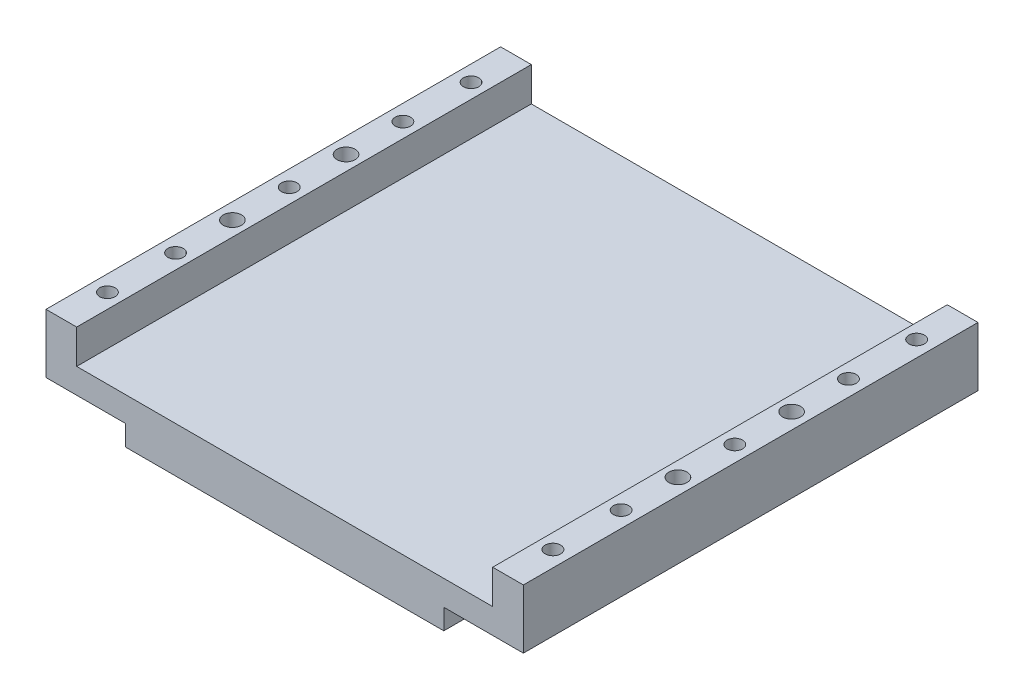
ISO-10303-21;
HEADER;
FILE_DESCRIPTION(('STEP AP214'),'2;1');
FILE_NAME('part.step','',(''),(''),'','','');
FILE_SCHEMA(('AUTOMOTIVE_DESIGN { 1 0 10303 214 1 1 1 1 }'));
ENDSEC;
DATA;
#1=APPLICATION_CONTEXT('core data for automotive mechanical design processes');
#2=APPLICATION_PROTOCOL_DEFINITION('international standard','automotive_design',2000,#1);
#3=PRODUCT_CONTEXT('',#1,'mechanical');
#4=PRODUCT('Part','Part','',(#3));
#5=PRODUCT_RELATED_PRODUCT_CATEGORY('part','',(#4));
#6=PRODUCT_DEFINITION_FORMATION('','',#4);
#7=PRODUCT_DEFINITION_CONTEXT('part definition',#1,'design');
#8=PRODUCT_DEFINITION('design','',#6,#7);
#9=PRODUCT_DEFINITION_SHAPE('','',#8);
#10=(LENGTH_UNIT() NAMED_UNIT(*) SI_UNIT(.MILLI.,.METRE.));
#11=(NAMED_UNIT(*) PLANE_ANGLE_UNIT() SI_UNIT($,.RADIAN.));
#12=(NAMED_UNIT(*) SI_UNIT($,.STERADIAN.) SOLID_ANGLE_UNIT());
#13=UNCERTAINTY_MEASURE_WITH_UNIT(LENGTH_MEASURE(1.E-05),#10,'distance_accuracy_value','');
#14=(GEOMETRIC_REPRESENTATION_CONTEXT(3) GLOBAL_UNCERTAINTY_ASSIGNED_CONTEXT((#13)) GLOBAL_UNIT_ASSIGNED_CONTEXT((#10,
#11,#12)) REPRESENTATION_CONTEXT('',''));
#15=CARTESIAN_POINT('',(0.,0.,0.));
#16=DIRECTION('',(0.,0.,1.));
#17=DIRECTION('',(1.,0.,0.));
#18=AXIS2_PLACEMENT_3D('',#15,#16,#17);
#19=CARTESIAN_POINT('',(-98.,23.,50.));
#20=DIRECTION('',(0.,1.,0.));
#21=DIRECTION('',(0.,0.,1.));
#22=AXIS2_PLACEMENT_3D('',#19,#20,#21);
#23=PLANE('',#22);
#24=CARTESIAN_POINT('',(-98.,23.,50.));
#25=DIRECTION('',(0.,1.,0.));
#26=DIRECTION('',(0.,0.,1.));
#27=AXIS2_PLACEMENT_3D('',#24,#25,#26);
#28=CIRCLE('',#27,3.4);
#29=CARTESIAN_POINT('',(-98.,23.,53.4));
#30=VERTEX_POINT('',#29);
#31=EDGE_CURVE('E19',#30,#30,#28,.T.);
#32=ORIENTED_EDGE('',*,*,#31,.T.);
#33=EDGE_LOOP('',(#32));
#34=FACE_BOUND('',#33,.T.);
#35=ADVANCED_FACE('F16',(#34),#23,.T.);
#36=CARTESIAN_POINT('',(-98.,23.,-50.));
#37=DIRECTION('',(0.,1.,0.));
#38=DIRECTION('',(0.,0.,1.));
#39=AXIS2_PLACEMENT_3D('',#36,#37,#38);
#40=PLANE('',#39);
#41=CARTESIAN_POINT('',(-98.,23.,-50.));
#42=DIRECTION('',(0.,1.,0.));
#43=DIRECTION('',(0.,0.,1.));
#44=AXIS2_PLACEMENT_3D('',#41,#42,#43);
#45=CIRCLE('',#44,3.4);
#46=CARTESIAN_POINT('',(-98.,23.,-46.6));
#47=VERTEX_POINT('',#46);
#48=EDGE_CURVE('E224',#47,#47,#45,.T.);
#49=ORIENTED_EDGE('',*,*,#48,.T.);
#50=EDGE_LOOP('',(#49));
#51=FACE_BOUND('',#50,.T.);
#52=ADVANCED_FACE('F359',(#51),#40,.T.);
#53=CARTESIAN_POINT('',(-98.,23.,80.));
#54=DIRECTION('',(0.,1.,0.));
#55=DIRECTION('',(0.,0.,1.));
#56=AXIS2_PLACEMENT_3D('',#53,#54,#55);
#57=PLANE('',#56);
#58=CARTESIAN_POINT('',(-98.,23.,80.));
#59=DIRECTION('',(0.,1.,0.));
#60=DIRECTION('',(0.,0.,1.));
#61=AXIS2_PLACEMENT_3D('',#58,#59,#60);
#62=CIRCLE('',#61,3.4);
#63=CARTESIAN_POINT('',(-98.,23.,83.4));
#64=VERTEX_POINT('',#63);
#65=EDGE_CURVE('E222',#64,#64,#62,.T.);
#66=ORIENTED_EDGE('',*,*,#65,.T.);
#67=EDGE_LOOP('',(#66));
#68=FACE_BOUND('',#67,.T.);
#69=ADVANCED_FACE('F356',(#68),#57,.T.);
#70=CARTESIAN_POINT('',(-98.,23.,0.));
#71=DIRECTION('',(0.,1.,0.));
#72=DIRECTION('',(0.,0.,1.));
#73=AXIS2_PLACEMENT_3D('',#70,#71,#72);
#74=PLANE('',#73);
#75=CARTESIAN_POINT('',(-98.,23.,0.));
#76=DIRECTION('',(0.,1.,0.));
#77=DIRECTION('',(0.,0.,1.));
#78=AXIS2_PLACEMENT_3D('',#75,#76,#77);
#79=CIRCLE('',#78,3.4);
#80=CARTESIAN_POINT('',(-98.,23.,3.4));
#81=VERTEX_POINT('',#80);
#82=EDGE_CURVE('E219',#81,#81,#79,.T.);
#83=ORIENTED_EDGE('',*,*,#82,.T.);
#84=EDGE_LOOP('',(#83));
#85=FACE_BOUND('',#84,.T.);
#86=ADVANCED_FACE('F358',(#85),#74,.T.);
#87=CARTESIAN_POINT('',(-98.,23.,-80.));
#88=DIRECTION('',(0.,1.,0.));
#89=DIRECTION('',(0.,0.,1.));
#90=AXIS2_PLACEMENT_3D('',#87,#88,#89);
#91=PLANE('',#90);
#92=CARTESIAN_POINT('',(-98.,23.,-80.));
#93=DIRECTION('',(0.,1.,0.));
#94=DIRECTION('',(0.,0.,1.));
#95=AXIS2_PLACEMENT_3D('',#92,#93,#94);
#96=CIRCLE('',#95,3.4);
#97=CARTESIAN_POINT('',(-98.,23.,-76.6));
#98=VERTEX_POINT('',#97);
#99=EDGE_CURVE('E216',#98,#98,#96,.T.);
#100=ORIENTED_EDGE('',*,*,#99,.T.);
#101=EDGE_LOOP('',(#100));
#102=FACE_BOUND('',#101,.T.);
#103=ADVANCED_FACE('F365',(#102),#91,.T.);
#104=CARTESIAN_POINT('',(98.,23.,50.));
#105=DIRECTION('',(0.,1.,0.));
#106=DIRECTION('',(0.,0.,1.));
#107=AXIS2_PLACEMENT_3D('',#104,#105,#106);
#108=PLANE('',#107);
#109=CARTESIAN_POINT('',(98.,23.,50.));
#110=DIRECTION('',(0.,1.,0.));
#111=DIRECTION('',(0.,0.,1.));
#112=AXIS2_PLACEMENT_3D('',#109,#110,#111);
#113=CIRCLE('',#112,3.4);
#114=CARTESIAN_POINT('',(98.,23.,53.4));
#115=VERTEX_POINT('',#114);
#116=EDGE_CURVE('E213',#115,#115,#113,.T.);
#117=ORIENTED_EDGE('',*,*,#116,.T.);
#118=EDGE_LOOP('',(#117));
#119=FACE_BOUND('',#118,.T.);
#120=ADVANCED_FACE('F371',(#119),#108,.T.);
#121=CARTESIAN_POINT('',(98.,23.,-50.));
#122=DIRECTION('',(0.,1.,0.));
#123=DIRECTION('',(0.,0.,1.));
#124=AXIS2_PLACEMENT_3D('',#121,#122,#123);
#125=PLANE('',#124);
#126=CARTESIAN_POINT('',(98.,23.,-50.));
#127=DIRECTION('',(0.,1.,0.));
#128=DIRECTION('',(0.,0.,1.));
#129=AXIS2_PLACEMENT_3D('',#126,#127,#128);
#130=CIRCLE('',#129,3.4);
#131=CARTESIAN_POINT('',(98.,23.,-46.6));
#132=VERTEX_POINT('',#131);
#133=EDGE_CURVE('E210',#132,#132,#130,.T.);
#134=ORIENTED_EDGE('',*,*,#133,.T.);
#135=EDGE_LOOP('',(#134));
#136=FACE_BOUND('',#135,.T.);
#137=ADVANCED_FACE('F375',(#136),#125,.T.);
#138=CARTESIAN_POINT('',(98.,23.,-80.));
#139=DIRECTION('',(0.,1.,0.));
#140=DIRECTION('',(0.,0.,1.));
#141=AXIS2_PLACEMENT_3D('',#138,#139,#140);
#142=PLANE('',#141);
#143=CARTESIAN_POINT('',(98.,23.,-80.));
#144=DIRECTION('',(0.,1.,0.));
#145=DIRECTION('',(0.,0.,1.));
#146=AXIS2_PLACEMENT_3D('',#143,#144,#145);
#147=CIRCLE('',#146,3.4);
#148=CARTESIAN_POINT('',(98.,23.,-76.6));
#149=VERTEX_POINT('',#148);
#150=EDGE_CURVE('E207',#149,#149,#147,.T.);
#151=ORIENTED_EDGE('',*,*,#150,.T.);
#152=EDGE_LOOP('',(#151));
#153=FACE_BOUND('',#152,.T.);
#154=ADVANCED_FACE('F379',(#153),#142,.T.);
#155=CARTESIAN_POINT('',(98.,23.,0.));
#156=DIRECTION('',(0.,1.,0.));
#157=DIRECTION('',(0.,0.,1.));
#158=AXIS2_PLACEMENT_3D('',#155,#156,#157);
#159=PLANE('',#158);
#160=CARTESIAN_POINT('',(98.,23.,0.));
#161=DIRECTION('',(0.,1.,0.));
#162=DIRECTION('',(0.,0.,1.));
#163=AXIS2_PLACEMENT_3D('',#160,#161,#162);
#164=CIRCLE('',#163,3.4);
#165=CARTESIAN_POINT('',(98.,23.,3.4));
#166=VERTEX_POINT('',#165);
#167=EDGE_CURVE('E204',#166,#166,#164,.T.);
#168=ORIENTED_EDGE('',*,*,#167,.T.);
#169=EDGE_LOOP('',(#168));
#170=FACE_BOUND('',#169,.T.);
#171=ADVANCED_FACE('F246',(#170),#159,.T.);
#172=CARTESIAN_POINT('',(98.,23.,80.));
#173=DIRECTION('',(0.,1.,0.));
#174=DIRECTION('',(0.,0.,1.));
#175=AXIS2_PLACEMENT_3D('',#172,#173,#174);
#176=PLANE('',#175);
#177=CARTESIAN_POINT('',(98.,23.,80.));
#178=DIRECTION('',(0.,1.,0.));
#179=DIRECTION('',(0.,0.,1.));
#180=AXIS2_PLACEMENT_3D('',#177,#178,#179);
#181=CIRCLE('',#180,3.4);
#182=CARTESIAN_POINT('',(98.,23.,83.4));
#183=VERTEX_POINT('',#182);
#184=EDGE_CURVE('E124',#183,#183,#181,.T.);
#185=ORIENTED_EDGE('',*,*,#184,.T.);
#186=EDGE_LOOP('',(#185));
#187=FACE_BOUND('',#186,.T.);
#188=ADVANCED_FACE('F235',(#187),#176,.T.);
#189=CARTESIAN_POINT('',(-98.,23.,50.));
#190=DIRECTION('',(0.,1.,0.));
#191=DIRECTION('',(0.,0.,1.));
#192=AXIS2_PLACEMENT_3D('',#189,#190,#191);
#193=CYLINDRICAL_SURFACE('',#192,3.4);
#194=CARTESIAN_POINT('',(-98.,35.,50.));
#195=DIRECTION('',(0.,1.,0.));
#196=DIRECTION('',(0.,0.,1.));
#197=AXIS2_PLACEMENT_3D('',#194,#195,#196);
#198=CIRCLE('',#197,3.4);
#199=CARTESIAN_POINT('',(-98.,35.,53.4));
#200=VERTEX_POINT('',#199);
#201=EDGE_CURVE('E193',#200,#200,#198,.F.);
#202=ORIENTED_EDGE('',*,*,#201,.F.);
#203=EDGE_LOOP('',(#202));
#204=FACE_BOUND('',#203,.T.);
#205=ORIENTED_EDGE('',*,*,#31,.F.);
#206=EDGE_LOOP('',(#205));
#207=FACE_BOUND('',#206,.T.);
#208=ADVANCED_FACE('F232',(#204,#207),#193,.F.);
#209=CARTESIAN_POINT('',(-98.,23.,-50.));
#210=DIRECTION('',(0.,1.,0.));
#211=DIRECTION('',(0.,0.,1.));
#212=AXIS2_PLACEMENT_3D('',#209,#210,#211);
#213=CYLINDRICAL_SURFACE('',#212,3.4);
#214=CARTESIAN_POINT('',(-98.,35.,-50.));
#215=DIRECTION('',(0.,1.,0.));
#216=DIRECTION('',(0.,0.,1.));
#217=AXIS2_PLACEMENT_3D('',#214,#215,#216);
#218=CIRCLE('',#217,3.4);
#219=CARTESIAN_POINT('',(-98.,35.,-46.6));
#220=VERTEX_POINT('',#219);
#221=EDGE_CURVE('E190',#220,#220,#218,.F.);
#222=ORIENTED_EDGE('',*,*,#221,.F.);
#223=EDGE_LOOP('',(#222));
#224=FACE_BOUND('',#223,.T.);
#225=ORIENTED_EDGE('',*,*,#48,.F.);
#226=EDGE_LOOP('',(#225));
#227=FACE_BOUND('',#226,.T.);
#228=ADVANCED_FACE('F234',(#224,#227),#213,.F.);
#229=CARTESIAN_POINT('',(-98.,23.,80.));
#230=DIRECTION('',(0.,1.,0.));
#231=DIRECTION('',(0.,0.,1.));
#232=AXIS2_PLACEMENT_3D('',#229,#230,#231);
#233=CYLINDRICAL_SURFACE('',#232,3.4);
#234=CARTESIAN_POINT('',(-98.,35.,80.));
#235=DIRECTION('',(0.,1.,0.));
#236=DIRECTION('',(0.,0.,1.));
#237=AXIS2_PLACEMENT_3D('',#234,#235,#236);
#238=CIRCLE('',#237,3.4);
#239=CARTESIAN_POINT('',(-98.,35.,83.4));
#240=VERTEX_POINT('',#239);
#241=EDGE_CURVE('E187',#240,#240,#238,.F.);
#242=ORIENTED_EDGE('',*,*,#241,.F.);
#243=EDGE_LOOP('',(#242));
#244=FACE_BOUND('',#243,.T.);
#245=ORIENTED_EDGE('',*,*,#65,.F.);
#246=EDGE_LOOP('',(#245));
#247=FACE_BOUND('',#246,.T.);
#248=ADVANCED_FACE('F243',(#244,#247),#233,.F.);
#249=CARTESIAN_POINT('',(-98.,23.,0.));
#250=DIRECTION('',(0.,1.,0.));
#251=DIRECTION('',(0.,0.,1.));
#252=AXIS2_PLACEMENT_3D('',#249,#250,#251);
#253=CYLINDRICAL_SURFACE('',#252,3.4);
#254=CARTESIAN_POINT('',(-98.,35.,0.));
#255=DIRECTION('',(0.,1.,0.));
#256=DIRECTION('',(0.,0.,1.));
#257=AXIS2_PLACEMENT_3D('',#254,#255,#256);
#258=CIRCLE('',#257,3.4);
#259=CARTESIAN_POINT('',(-98.,35.,3.4));
#260=VERTEX_POINT('',#259);
#261=EDGE_CURVE('E184',#260,#260,#258,.F.);
#262=ORIENTED_EDGE('',*,*,#261,.F.);
#263=EDGE_LOOP('',(#262));
#264=FACE_BOUND('',#263,.T.);
#265=ORIENTED_EDGE('',*,*,#82,.F.);
#266=EDGE_LOOP('',(#265));
#267=FACE_BOUND('',#266,.T.);
#268=ADVANCED_FACE('F343',(#264,#267),#253,.F.);
#269=CARTESIAN_POINT('',(-98.,23.,-80.));
#270=DIRECTION('',(0.,1.,0.));
#271=DIRECTION('',(0.,0.,1.));
#272=AXIS2_PLACEMENT_3D('',#269,#270,#271);
#273=CYLINDRICAL_SURFACE('',#272,3.4);
#274=CARTESIAN_POINT('',(-98.,35.,-80.));
#275=DIRECTION('',(0.,1.,0.));
#276=DIRECTION('',(0.,0.,1.));
#277=AXIS2_PLACEMENT_3D('',#274,#275,#276);
#278=CIRCLE('',#277,3.4);
#279=CARTESIAN_POINT('',(-98.,35.,-76.6));
#280=VERTEX_POINT('',#279);
#281=EDGE_CURVE('E181',#280,#280,#278,.F.);
#282=ORIENTED_EDGE('',*,*,#281,.F.);
#283=EDGE_LOOP('',(#282));
#284=FACE_BOUND('',#283,.T.);
#285=ORIENTED_EDGE('',*,*,#99,.F.);
#286=EDGE_LOOP('',(#285));
#287=FACE_BOUND('',#286,.T.);
#288=ADVANCED_FACE('F339',(#284,#287),#273,.F.);
#289=CARTESIAN_POINT('',(-98.,9.,25.));
#290=DIRECTION('',(0.,1.,0.));
#291=DIRECTION('',(0.,0.,1.));
#292=AXIS2_PLACEMENT_3D('',#289,#290,#291);
#293=CYLINDRICAL_SURFACE('',#292,4.);
#294=CARTESIAN_POINT('',(-98.,9.,25.));
#295=DIRECTION('',(0.,1.,0.));
#296=DIRECTION('',(0.,0.,1.));
#297=AXIS2_PLACEMENT_3D('',#294,#295,#296);
#298=CIRCLE('',#297,4.);
#299=CARTESIAN_POINT('',(-98.,9.,29.));
#300=VERTEX_POINT('',#299);
#301=EDGE_CURVE('E148',#300,#300,#298,.F.);
#302=ORIENTED_EDGE('',*,*,#301,.T.);
#303=EDGE_LOOP('',(#302));
#304=FACE_BOUND('',#303,.T.);
#305=CARTESIAN_POINT('',(-98.,35.,25.));
#306=DIRECTION('',(0.,1.,0.));
#307=DIRECTION('',(0.,0.,1.));
#308=AXIS2_PLACEMENT_3D('',#305,#306,#307);
#309=CIRCLE('',#308,4.);
#310=CARTESIAN_POINT('',(-98.,35.,29.));
#311=VERTEX_POINT('',#310);
#312=EDGE_CURVE('E153',#311,#311,#309,.F.);
#313=ORIENTED_EDGE('',*,*,#312,.F.);
#314=EDGE_LOOP('',(#313));
#315=FACE_BOUND('',#314,.T.);
#316=ADVANCED_FACE('F335',(#304,#315),#293,.F.);
#317=CARTESIAN_POINT('',(-98.,35.,-25.));
#318=DIRECTION('',(0.,1.,0.));
#319=DIRECTION('',(0.,0.,1.));
#320=AXIS2_PLACEMENT_3D('',#317,#318,#319);
#321=CYLINDRICAL_SURFACE('',#320,4.);
#322=CARTESIAN_POINT('',(-98.,9.,-25.));
#323=DIRECTION('',(0.,1.,0.));
#324=DIRECTION('',(0.,0.,1.));
#325=AXIS2_PLACEMENT_3D('',#322,#323,#324);
#326=CIRCLE('',#325,4.);
#327=CARTESIAN_POINT('',(-98.,9.,-21.));
#328=VERTEX_POINT('',#327);
#329=EDGE_CURVE('E145',#328,#328,#326,.F.);
#330=ORIENTED_EDGE('',*,*,#329,.T.);
#331=EDGE_LOOP('',(#330));
#332=FACE_BOUND('',#331,.T.);
#333=CARTESIAN_POINT('',(-98.,35.,-25.));
#334=DIRECTION('',(0.,1.,0.));
#335=DIRECTION('',(0.,0.,1.));
#336=AXIS2_PLACEMENT_3D('',#333,#334,#335);
#337=CIRCLE('',#336,4.);
#338=CARTESIAN_POINT('',(-98.,35.,-21.));
#339=VERTEX_POINT('',#338);
#340=EDGE_CURVE('E151',#339,#339,#337,.F.);
#341=ORIENTED_EDGE('',*,*,#340,.F.);
#342=EDGE_LOOP('',(#341));
#343=FACE_BOUND('',#342,.T.);
#344=ADVANCED_FACE('F331',(#332,#343),#321,.F.);
#345=CARTESIAN_POINT('',(98.,9.,25.));
#346=DIRECTION('',(0.,1.,0.));
#347=DIRECTION('',(0.,0.,1.));
#348=AXIS2_PLACEMENT_3D('',#345,#346,#347);
#349=CYLINDRICAL_SURFACE('',#348,4.);
#350=CARTESIAN_POINT('',(98.,35.,25.));
#351=DIRECTION('',(0.,1.,0.));
#352=DIRECTION('',(0.,0.,1.));
#353=AXIS2_PLACEMENT_3D('',#350,#351,#352);
#354=CIRCLE('',#353,4.);
#355=CARTESIAN_POINT('',(98.,35.,29.));
#356=VERTEX_POINT('',#355);
#357=EDGE_CURVE('E139',#356,#356,#354,.F.);
#358=ORIENTED_EDGE('',*,*,#357,.F.);
#359=EDGE_LOOP('',(#358));
#360=FACE_BOUND('',#359,.T.);
#361=CARTESIAN_POINT('',(98.,9.,25.));
#362=DIRECTION('',(0.,1.,0.));
#363=DIRECTION('',(0.,0.,1.));
#364=AXIS2_PLACEMENT_3D('',#361,#362,#363);
#365=CIRCLE('',#364,4.);
#366=CARTESIAN_POINT('',(98.,9.,29.));
#367=VERTEX_POINT('',#366);
#368=EDGE_CURVE('E123',#367,#367,#365,.F.);
#369=ORIENTED_EDGE('',*,*,#368,.T.);
#370=EDGE_LOOP('',(#369));
#371=FACE_BOUND('',#370,.T.);
#372=ADVANCED_FACE('F327',(#360,#371),#349,.F.);
#373=CARTESIAN_POINT('',(98.,23.,50.));
#374=DIRECTION('',(0.,1.,0.));
#375=DIRECTION('',(0.,0.,1.));
#376=AXIS2_PLACEMENT_3D('',#373,#374,#375);
#377=CYLINDRICAL_SURFACE('',#376,3.4);
#378=CARTESIAN_POINT('',(98.,35.,50.));
#379=DIRECTION('',(0.,1.,0.));
#380=DIRECTION('',(0.,0.,1.));
#381=AXIS2_PLACEMENT_3D('',#378,#379,#380);
#382=CIRCLE('',#381,3.4);
#383=CARTESIAN_POINT('',(98.,35.,53.4));
#384=VERTEX_POINT('',#383);
#385=EDGE_CURVE('E170',#384,#384,#382,.F.);
#386=ORIENTED_EDGE('',*,*,#385,.F.);
#387=EDGE_LOOP('',(#386));
#388=FACE_BOUND('',#387,.T.);
#389=ORIENTED_EDGE('',*,*,#116,.F.);
#390=EDGE_LOOP('',(#389));
#391=FACE_BOUND('',#390,.T.);
#392=ADVANCED_FACE('F323',(#388,#391),#377,.F.);
#393=CARTESIAN_POINT('',(98.,23.,-50.));
#394=DIRECTION('',(0.,1.,0.));
#395=DIRECTION('',(0.,0.,1.));
#396=AXIS2_PLACEMENT_3D('',#393,#394,#395);
#397=CYLINDRICAL_SURFACE('',#396,3.4);
#398=CARTESIAN_POINT('',(98.,35.,-50.));
#399=DIRECTION('',(0.,1.,0.));
#400=DIRECTION('',(0.,0.,1.));
#401=AXIS2_PLACEMENT_3D('',#398,#399,#400);
#402=CIRCLE('',#401,3.4);
#403=CARTESIAN_POINT('',(98.,35.,-46.6));
#404=VERTEX_POINT('',#403);
#405=EDGE_CURVE('E167',#404,#404,#402,.F.);
#406=ORIENTED_EDGE('',*,*,#405,.F.);
#407=EDGE_LOOP('',(#406));
#408=FACE_BOUND('',#407,.T.);
#409=ORIENTED_EDGE('',*,*,#133,.F.);
#410=EDGE_LOOP('',(#409));
#411=FACE_BOUND('',#410,.T.);
#412=ADVANCED_FACE('F319',(#408,#411),#397,.F.);
#413=CARTESIAN_POINT('',(98.,23.,-80.));
#414=DIRECTION('',(0.,1.,0.));
#415=DIRECTION('',(0.,0.,1.));
#416=AXIS2_PLACEMENT_3D('',#413,#414,#415);
#417=CYLINDRICAL_SURFACE('',#416,3.4);
#418=CARTESIAN_POINT('',(98.,35.,-80.));
#419=DIRECTION('',(0.,1.,0.));
#420=DIRECTION('',(0.,0.,1.));
#421=AXIS2_PLACEMENT_3D('',#418,#419,#420);
#422=CIRCLE('',#421,3.4);
#423=CARTESIAN_POINT('',(98.,35.,-76.6));
#424=VERTEX_POINT('',#423);
#425=EDGE_CURVE('E164',#424,#424,#422,.F.);
#426=ORIENTED_EDGE('',*,*,#425,.F.);
#427=EDGE_LOOP('',(#426));
#428=FACE_BOUND('',#427,.T.);
#429=ORIENTED_EDGE('',*,*,#150,.F.);
#430=EDGE_LOOP('',(#429));
#431=FACE_BOUND('',#430,.T.);
#432=ADVANCED_FACE('F315',(#428,#431),#417,.F.);
#433=CARTESIAN_POINT('',(98.,23.,0.));
#434=DIRECTION('',(0.,1.,0.));
#435=DIRECTION('',(0.,0.,1.));
#436=AXIS2_PLACEMENT_3D('',#433,#434,#435);
#437=CYLINDRICAL_SURFACE('',#436,3.4);
#438=CARTESIAN_POINT('',(98.,35.,0.));
#439=DIRECTION('',(0.,1.,0.));
#440=DIRECTION('',(0.,0.,1.));
#441=AXIS2_PLACEMENT_3D('',#438,#439,#440);
#442=CIRCLE('',#441,3.4);
#443=CARTESIAN_POINT('',(98.,35.,3.4));
#444=VERTEX_POINT('',#443);
#445=EDGE_CURVE('E161',#444,#444,#442,.F.);
#446=ORIENTED_EDGE('',*,*,#445,.F.);
#447=EDGE_LOOP('',(#446));
#448=FACE_BOUND('',#447,.T.);
#449=ORIENTED_EDGE('',*,*,#167,.F.);
#450=EDGE_LOOP('',(#449));
#451=FACE_BOUND('',#450,.T.);
#452=ADVANCED_FACE('F311',(#448,#451),#437,.F.);
#453=CARTESIAN_POINT('',(98.,23.,80.));
#454=DIRECTION('',(0.,1.,0.));
#455=DIRECTION('',(0.,0.,1.));
#456=AXIS2_PLACEMENT_3D('',#453,#454,#455);
#457=CYLINDRICAL_SURFACE('',#456,3.4);
#458=CARTESIAN_POINT('',(98.,35.,80.));
#459=DIRECTION('',(0.,1.,0.));
#460=DIRECTION('',(0.,0.,1.));
#461=AXIS2_PLACEMENT_3D('',#458,#459,#460);
#462=CIRCLE('',#461,3.4);
#463=CARTESIAN_POINT('',(98.,35.,83.4));
#464=VERTEX_POINT('',#463);
#465=EDGE_CURVE('E158',#464,#464,#462,.F.);
#466=ORIENTED_EDGE('',*,*,#465,.F.);
#467=EDGE_LOOP('',(#466));
#468=FACE_BOUND('',#467,.T.);
#469=ORIENTED_EDGE('',*,*,#184,.F.);
#470=EDGE_LOOP('',(#469));
#471=FACE_BOUND('',#470,.T.);
#472=ADVANCED_FACE('F307',(#468,#471),#457,.F.);
#473=CARTESIAN_POINT('',(98.,35.,-25.));
#474=DIRECTION('',(0.,1.,0.));
#475=DIRECTION('',(0.,0.,1.));
#476=AXIS2_PLACEMENT_3D('',#473,#474,#475);
#477=CYLINDRICAL_SURFACE('',#476,4.);
#478=CARTESIAN_POINT('',(98.,35.,-25.));
#479=DIRECTION('',(0.,1.,0.));
#480=DIRECTION('',(0.,0.,1.));
#481=AXIS2_PLACEMENT_3D('',#478,#479,#480);
#482=CIRCLE('',#481,4.);
#483=CARTESIAN_POINT('',(98.,35.,-21.));
#484=VERTEX_POINT('',#483);
#485=EDGE_CURVE('E115',#484,#484,#482,.F.);
#486=ORIENTED_EDGE('',*,*,#485,.F.);
#487=EDGE_LOOP('',(#486));
#488=FACE_BOUND('',#487,.T.);
#489=CARTESIAN_POINT('',(98.,9.,-25.));
#490=DIRECTION('',(0.,1.,0.));
#491=DIRECTION('',(0.,0.,1.));
#492=AXIS2_PLACEMENT_3D('',#489,#490,#491);
#493=CIRCLE('',#492,4.);
#494=CARTESIAN_POINT('',(98.,9.,-21.));
#495=VERTEX_POINT('',#494);
#496=EDGE_CURVE('E154',#495,#495,#493,.F.);
#497=ORIENTED_EDGE('',*,*,#496,.T.);
#498=EDGE_LOOP('',(#497));
#499=FACE_BOUND('',#498,.T.);
#500=ADVANCED_FACE('F304',(#488,#499),#477,.F.);
#501=CARTESIAN_POINT('',(70.,4.5,0.));
#502=DIRECTION('',(1.,0.,0.));
#503=DIRECTION('',(0.,0.,-1.));
#504=AXIS2_PLACEMENT_3D('',#501,#502,#503);
#505=PLANE('',#504);
#506=DIRECTION('',(0.,1.,0.));
#507=VECTOR('',#506,1.);
#508=CARTESIAN_POINT('',(69.99999997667,17.5,100.));
#509=LINE('',#508,#507);
#510=CARTESIAN_POINT('',(69.999999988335,0.,100.));
#511=VERTEX_POINT('',#510);
#512=CARTESIAN_POINT('',(69.999999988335,8.99999999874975,100.));
#513=VERTEX_POINT('',#512);
#514=EDGE_CURVE('E658',#511,#513,#509,.T.);
#515=ORIENTED_EDGE('',*,*,#514,.F.);
#516=DIRECTION('',(0.,0.,1.));
#517=VECTOR('',#516,1.);
#518=CARTESIAN_POINT('',(69.99999997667,0.,0.));
#519=LINE('',#518,#517);
#520=CARTESIAN_POINT('',(69.999999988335,0.,-100.));
#521=VERTEX_POINT('',#520);
#522=EDGE_CURVE('E103',#511,#521,#519,.F.);
#523=ORIENTED_EDGE('',*,*,#522,.T.);
#524=DIRECTION('',(0.,1.,0.));
#525=VECTOR('',#524,1.);
#526=CARTESIAN_POINT('',(69.99999997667,17.5,-100.));
#527=LINE('',#526,#525);
#528=CARTESIAN_POINT('',(69.999999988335,8.99999999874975,-100.));
#529=VERTEX_POINT('',#528);
#530=EDGE_CURVE('E106',#521,#529,#527,.T.);
#531=ORIENTED_EDGE('',*,*,#530,.T.);
#532=DIRECTION('',(0.,0.,1.));
#533=VECTOR('',#532,1.);
#534=CARTESIAN_POINT('',(69.99999997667,9.,0.));
#535=LINE('',#534,#533);
#536=EDGE_CURVE('E109',#529,#513,#535,.T.);
#537=ORIENTED_EDGE('',*,*,#536,.T.);
#538=EDGE_LOOP('',(#515,#523,#531,#537));
#539=FACE_BOUND('',#538,.T.);
#540=ADVANCED_FACE('F108',(#539),#505,.T.);
#541=CARTESIAN_POINT('',(87.5,9.,0.));
#542=DIRECTION('',(0.,1.,0.));
#543=DIRECTION('',(0.,0.,1.));
#544=AXIS2_PLACEMENT_3D('',#541,#542,#543);
#545=PLANE('',#544);
#546=ORIENTED_EDGE('',*,*,#496,.F.);
#547=EDGE_LOOP('',(#546));
#548=FACE_BOUND('',#547,.T.);
#549=ORIENTED_EDGE('',*,*,#368,.F.);
#550=EDGE_LOOP('',(#549));
#551=FACE_BOUND('',#550,.T.);
#552=DIRECTION('',(0.,0.,-1.));
#553=VECTOR('',#552,1.);
#554=CARTESIAN_POINT('',(105.,8.999999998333,0.));
#555=LINE('',#554,#553);
#556=CARTESIAN_POINT('',(105.,8.9999999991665,100.));
#557=VERTEX_POINT('',#556);
#558=CARTESIAN_POINT('',(105.,8.9999999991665,-100.));
#559=VERTEX_POINT('',#558);
#560=EDGE_CURVE('E152',#557,#559,#555,.T.);
#561=ORIENTED_EDGE('',*,*,#560,.F.);
#562=DIRECTION('',(1.,0.,0.));
#563=VECTOR('',#562,1.);
#564=CARTESIAN_POINT('',(0.,8.999999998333,100.));
#565=LINE('',#564,#563);
#566=EDGE_CURVE('E121',#513,#557,#565,.T.);
#567=ORIENTED_EDGE('',*,*,#566,.F.);
#568=ORIENTED_EDGE('',*,*,#536,.F.);
#569=DIRECTION('',(1.,0.,0.));
#570=VECTOR('',#569,1.);
#571=CARTESIAN_POINT('',(0.,8.999999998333,-100.));
#572=LINE('',#571,#570);
#573=EDGE_CURVE('E114',#529,#559,#572,.T.);
#574=ORIENTED_EDGE('',*,*,#573,.T.);
#575=EDGE_LOOP('',(#561,#567,#568,#574));
#576=FACE_BOUND('',#575,.T.);
#577=ADVANCED_FACE('F118',(#548,#551,#576),#545,.F.);
#578=CARTESIAN_POINT('',(105.,22.,0.));
#579=DIRECTION('',(1.,0.,0.));
#580=DIRECTION('',(0.,0.,-1.));
#581=AXIS2_PLACEMENT_3D('',#578,#579,#580);
#582=PLANE('',#581);
#583=DIRECTION('',(0.,1.,0.));
#584=VECTOR('',#583,1.);
#585=CARTESIAN_POINT('',(105.,17.5,100.));
#586=LINE('',#585,#584);
#587=CARTESIAN_POINT('',(105.,35.,100.));
#588=VERTEX_POINT('',#587);
#589=EDGE_CURVE('E651',#557,#588,#586,.T.);
#590=ORIENTED_EDGE('',*,*,#589,.F.);
#591=ORIENTED_EDGE('',*,*,#560,.T.);
#592=DIRECTION('',(0.,1.,0.));
#593=VECTOR('',#592,1.);
#594=CARTESIAN_POINT('',(105.,17.5,-100.));
#595=LINE('',#594,#593);
#596=CARTESIAN_POINT('',(105.,35.,-100.));
#597=VERTEX_POINT('',#596);
#598=EDGE_CURVE('E130',#559,#597,#595,.T.);
#599=ORIENTED_EDGE('',*,*,#598,.T.);
#600=DIRECTION('',(0.,0.,1.));
#601=VECTOR('',#600,1.);
#602=CARTESIAN_POINT('',(105.,35.,0.));
#603=LINE('',#602,#601);
#604=EDGE_CURVE('E136',#588,#597,#603,.F.);
#605=ORIENTED_EDGE('',*,*,#604,.F.);
#606=EDGE_LOOP('',(#590,#591,#599,#605));
#607=FACE_BOUND('',#606,.T.);
#608=ADVANCED_FACE('F294',(#607),#582,.T.);
#609=CARTESIAN_POINT('',(-98.25,35.,0.));
#610=DIRECTION('',(0.,1.,0.));
#611=DIRECTION('',(0.,0.,1.));
#612=AXIS2_PLACEMENT_3D('',#609,#610,#611);
#613=PLANE('',#612);
#614=ORIENTED_EDGE('',*,*,#340,.T.);
#615=EDGE_LOOP('',(#614));
#616=FACE_BOUND('',#615,.T.);
#617=ORIENTED_EDGE('',*,*,#281,.T.);
#618=EDGE_LOOP('',(#617));
#619=FACE_BOUND('',#618,.T.);
#620=ORIENTED_EDGE('',*,*,#261,.T.);
#621=EDGE_LOOP('',(#620));
#622=FACE_BOUND('',#621,.T.);
#623=ORIENTED_EDGE('',*,*,#241,.T.);
#624=EDGE_LOOP('',(#623));
#625=FACE_BOUND('',#624,.T.);
#626=ORIENTED_EDGE('',*,*,#221,.T.);
#627=EDGE_LOOP('',(#626));
#628=FACE_BOUND('',#627,.T.);
#629=ORIENTED_EDGE('',*,*,#201,.T.);
#630=EDGE_LOOP('',(#629));
#631=FACE_BOUND('',#630,.T.);
#632=ORIENTED_EDGE('',*,*,#312,.T.);
#633=EDGE_LOOP('',(#632));
#634=FACE_BOUND('',#633,.T.);
#635=DIRECTION('',(1.,0.,0.));
#636=VECTOR('',#635,1.);
#637=CARTESIAN_POINT('',(0.,35.,100.));
#638=LINE('',#637,#636);
#639=CARTESIAN_POINT('',(-91.50000001,35.,100.));
#640=VERTEX_POINT('',#639);
#641=CARTESIAN_POINT('',(-105.,35.,100.));
#642=VERTEX_POINT('',#641);
#643=EDGE_CURVE('E636',#640,#642,#638,.F.);
#644=ORIENTED_EDGE('',*,*,#643,.F.);
#645=DIRECTION('',(0.,0.,-1.));
#646=VECTOR('',#645,1.);
#647=CARTESIAN_POINT('',(-91.5,35.,0.));
#648=LINE('',#647,#646);
#649=CARTESIAN_POINT('',(-91.500000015,35.,-100.));
#650=VERTEX_POINT('',#649);
#651=EDGE_CURVE('E638',#650,#640,#648,.F.);
#652=ORIENTED_EDGE('',*,*,#651,.F.);
#653=DIRECTION('',(1.,0.,0.));
#654=VECTOR('',#653,1.);
#655=CARTESIAN_POINT('',(0.,35.,-100.));
#656=LINE('',#655,#654);
#657=CARTESIAN_POINT('',(-105.,35.,-100.));
#658=VERTEX_POINT('',#657);
#659=EDGE_CURVE('E671',#650,#658,#656,.F.);
#660=ORIENTED_EDGE('',*,*,#659,.T.);
#661=DIRECTION('',(0.,0.,-1.));
#662=VECTOR('',#661,1.);
#663=CARTESIAN_POINT('',(-105.,35.,0.));
#664=LINE('',#663,#662);
#665=EDGE_CURVE('E149',#658,#642,#664,.F.);
#666=ORIENTED_EDGE('',*,*,#665,.T.);
#667=EDGE_LOOP('',(#644,#652,#660,#666));
#668=FACE_BOUND('',#667,.T.);
#669=ADVANCED_FACE('F290',(#616,#619,#622,#625,#628,#631,#634,#668),#613,.T.);
#670=CARTESIAN_POINT('',(-105.,22.,0.));
#671=DIRECTION('',(1.,0.,0.));
#672=DIRECTION('',(0.,0.,-1.));
#673=AXIS2_PLACEMENT_3D('',#670,#671,#672);
#674=PLANE('',#673);
#675=DIRECTION('',(0.,0.,1.));
#676=VECTOR('',#675,1.);
#677=CARTESIAN_POINT('',(-105.,9.,0.));
#678=LINE('',#677,#676);
#679=CARTESIAN_POINT('',(-105.,8.99999999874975,-100.));
#680=VERTEX_POINT('',#679);
#681=CARTESIAN_POINT('',(-105.,8.99999999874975,100.));
#682=VERTEX_POINT('',#681);
#683=EDGE_CURVE('E146',#680,#682,#678,.T.);
#684=ORIENTED_EDGE('',*,*,#683,.T.);
#685=DIRECTION('',(0.,1.,0.));
#686=VECTOR('',#685,1.);
#687=CARTESIAN_POINT('',(-105.,17.5,100.));
#688=LINE('',#687,#686);
#689=EDGE_CURVE('E643',#642,#682,#688,.F.);
#690=ORIENTED_EDGE('',*,*,#689,.F.);
#691=ORIENTED_EDGE('',*,*,#665,.F.);
#692=DIRECTION('',(0.,1.,0.));
#693=VECTOR('',#692,1.);
#694=CARTESIAN_POINT('',(-105.,17.5,-100.));
#695=LINE('',#694,#693);
#696=EDGE_CURVE('E669',#658,#680,#695,.F.);
#697=ORIENTED_EDGE('',*,*,#696,.T.);
#698=EDGE_LOOP('',(#684,#690,#691,#697));
#699=FACE_BOUND('',#698,.T.);
#700=ADVANCED_FACE('F286',(#699),#674,.F.);
#701=CARTESIAN_POINT('',(-87.5,9.,0.));
#702=DIRECTION('',(0.,1.,0.));
#703=DIRECTION('',(0.,0.,1.));
#704=AXIS2_PLACEMENT_3D('',#701,#702,#703);
#705=PLANE('',#704);
#706=ORIENTED_EDGE('',*,*,#329,.F.);
#707=EDGE_LOOP('',(#706));
#708=FACE_BOUND('',#707,.T.);
#709=ORIENTED_EDGE('',*,*,#301,.F.);
#710=EDGE_LOOP('',(#709));
#711=FACE_BOUND('',#710,.T.);
#712=DIRECTION('',(0.,0.,-1.));
#713=VECTOR('',#712,1.);
#714=CARTESIAN_POINT('',(-70.,8.999999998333,0.));
#715=LINE('',#714,#713);
#716=CARTESIAN_POINT('',(-69.9999999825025,8.9999999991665,-100.));
#717=VERTEX_POINT('',#716);
#718=CARTESIAN_POINT('',(-69.9999999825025,8.9999999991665,100.));
#719=VERTEX_POINT('',#718);
#720=EDGE_CURVE('E143',#717,#719,#715,.F.);
#721=ORIENTED_EDGE('',*,*,#720,.T.);
#722=DIRECTION('',(1.,0.,0.));
#723=VECTOR('',#722,1.);
#724=CARTESIAN_POINT('',(0.,8.999999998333,100.));
#725=LINE('',#724,#723);
#726=EDGE_CURVE('E690',#682,#719,#725,.T.);
#727=ORIENTED_EDGE('',*,*,#726,.F.);
#728=ORIENTED_EDGE('',*,*,#683,.F.);
#729=DIRECTION('',(1.,0.,0.));
#730=VECTOR('',#729,1.);
#731=CARTESIAN_POINT('',(0.,8.999999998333,-100.));
#732=LINE('',#731,#730);
#733=EDGE_CURVE('E667',#680,#717,#732,.T.);
#734=ORIENTED_EDGE('',*,*,#733,.T.);
#735=EDGE_LOOP('',(#721,#727,#728,#734));
#736=FACE_BOUND('',#735,.T.);
#737=ADVANCED_FACE('F282',(#708,#711,#736),#705,.F.);
#738=CARTESIAN_POINT('',(-70.,4.5,0.));
#739=DIRECTION('',(1.,0.,0.));
#740=DIRECTION('',(0.,0.,-1.));
#741=AXIS2_PLACEMENT_3D('',#738,#739,#740);
#742=PLANE('',#741);
#743=DIRECTION('',(0.,0.,1.));
#744=VECTOR('',#743,1.);
#745=CARTESIAN_POINT('',(-69.99999997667,0.,0.));
#746=LINE('',#745,#744);
#747=CARTESIAN_POINT('',(-69.999999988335,0.,-100.));
#748=VERTEX_POINT('',#747);
#749=CARTESIAN_POINT('',(-69.999999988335,0.,100.));
#750=VERTEX_POINT('',#749);
#751=EDGE_CURVE('E141',#748,#750,#746,.T.);
#752=ORIENTED_EDGE('',*,*,#751,.T.);
#753=DIRECTION('',(0.,1.,0.));
#754=VECTOR('',#753,1.);
#755=CARTESIAN_POINT('',(-69.99999997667,17.5,100.));
#756=LINE('',#755,#754);
#757=EDGE_CURVE('E686',#719,#750,#756,.F.);
#758=ORIENTED_EDGE('',*,*,#757,.F.);
#759=ORIENTED_EDGE('',*,*,#720,.F.);
#760=DIRECTION('',(0.,1.,0.));
#761=VECTOR('',#760,1.);
#762=CARTESIAN_POINT('',(-69.99999997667,17.5,-100.));
#763=LINE('',#762,#761);
#764=EDGE_CURVE('E665',#717,#748,#763,.F.);
#765=ORIENTED_EDGE('',*,*,#764,.T.);
#766=EDGE_LOOP('',(#752,#758,#759,#765));
#767=FACE_BOUND('',#766,.T.);
#768=ADVANCED_FACE('F278',(#767),#742,.F.);
#769=CARTESIAN_POINT('',(0.,0.,0.));
#770=DIRECTION('',(0.,1.,0.));
#771=DIRECTION('',(0.,0.,1.));
#772=AXIS2_PLACEMENT_3D('',#769,#770,#771);
#773=PLANE('',#772);
#774=ORIENTED_EDGE('',*,*,#522,.F.);
#775=DIRECTION('',(1.,0.,0.));
#776=VECTOR('',#775,1.);
#777=CARTESIAN_POINT('',(0.,0.,100.));
#778=LINE('',#777,#776);
#779=EDGE_CURVE('E682',#750,#511,#778,.T.);
#780=ORIENTED_EDGE('',*,*,#779,.F.);
#781=ORIENTED_EDGE('',*,*,#751,.F.);
#782=DIRECTION('',(1.,0.,0.));
#783=VECTOR('',#782,1.);
#784=CARTESIAN_POINT('',(0.,0.,-100.));
#785=LINE('',#784,#783);
#786=EDGE_CURVE('E663',#748,#521,#785,.T.);
#787=ORIENTED_EDGE('',*,*,#786,.T.);
#788=EDGE_LOOP('',(#774,#780,#781,#787));
#789=FACE_BOUND('',#788,.T.);
#790=ADVANCED_FACE('F274',(#789),#773,.F.);
#791=CARTESIAN_POINT('',(98.25,35.,0.));
#792=DIRECTION('',(0.,1.,0.));
#793=DIRECTION('',(0.,0.,1.));
#794=AXIS2_PLACEMENT_3D('',#791,#792,#793);
#795=PLANE('',#794);
#796=ORIENTED_EDGE('',*,*,#485,.T.);
#797=EDGE_LOOP('',(#796));
#798=FACE_BOUND('',#797,.T.);
#799=ORIENTED_EDGE('',*,*,#465,.T.);
#800=EDGE_LOOP('',(#799));
#801=FACE_BOUND('',#800,.T.);
#802=ORIENTED_EDGE('',*,*,#445,.T.);
#803=EDGE_LOOP('',(#802));
#804=FACE_BOUND('',#803,.T.);
#805=ORIENTED_EDGE('',*,*,#425,.T.);
#806=EDGE_LOOP('',(#805));
#807=FACE_BOUND('',#806,.T.);
#808=ORIENTED_EDGE('',*,*,#405,.T.);
#809=EDGE_LOOP('',(#808));
#810=FACE_BOUND('',#809,.T.);
#811=ORIENTED_EDGE('',*,*,#385,.T.);
#812=EDGE_LOOP('',(#811));
#813=FACE_BOUND('',#812,.T.);
#814=ORIENTED_EDGE('',*,*,#357,.T.);
#815=EDGE_LOOP('',(#814));
#816=FACE_BOUND('',#815,.T.);
#817=DIRECTION('',(1.,0.,0.));
#818=VECTOR('',#817,1.);
#819=CARTESIAN_POINT('',(0.,35.,100.));
#820=LINE('',#819,#818);
#821=CARTESIAN_POINT('',(91.500000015,35.,100.));
#822=VERTEX_POINT('',#821);
#823=EDGE_CURVE('E649',#588,#822,#820,.F.);
#824=ORIENTED_EDGE('',*,*,#823,.F.);
#825=ORIENTED_EDGE('',*,*,#604,.T.);
#826=DIRECTION('',(1.,0.,0.));
#827=VECTOR('',#826,1.);
#828=CARTESIAN_POINT('',(0.,35.,-100.));
#829=LINE('',#828,#827);
#830=CARTESIAN_POINT('',(91.500000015,35.,-100.));
#831=VERTEX_POINT('',#830);
#832=EDGE_CURVE('E132',#597,#831,#829,.F.);
#833=ORIENTED_EDGE('',*,*,#832,.T.);
#834=DIRECTION('',(0.,0.,-1.));
#835=VECTOR('',#834,1.);
#836=CARTESIAN_POINT('',(91.5,35.,0.));
#837=LINE('',#836,#835);
#838=EDGE_CURVE('E676',#831,#822,#837,.F.);
#839=ORIENTED_EDGE('',*,*,#838,.T.);
#840=EDGE_LOOP('',(#824,#825,#833,#839));
#841=FACE_BOUND('',#840,.T.);
#842=ADVANCED_FACE('F271',(#798,#801,#804,#807,#810,#813,#816,#841),#795,.T.);
#843=CARTESIAN_POINT('',(0.,17.5,-100.));
#844=DIRECTION('',(0.,0.,1.));
#845=DIRECTION('',(1.,0.,0.));
#846=AXIS2_PLACEMENT_3D('',#843,#844,#845);
#847=PLANE('',#846);
#848=ORIENTED_EDGE('',*,*,#764,.F.);
#849=ORIENTED_EDGE('',*,*,#733,.F.);
#850=ORIENTED_EDGE('',*,*,#696,.F.);
#851=ORIENTED_EDGE('',*,*,#659,.F.);
#852=DIRECTION('',(0.,1.,0.));
#853=VECTOR('',#852,1.);
#854=CARTESIAN_POINT('',(-91.5,27.5,-100.));
#855=LINE('',#854,#853);
#856=CARTESIAN_POINT('',(-91.500000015,19.99999999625,-100.));
#857=VERTEX_POINT('',#856);
#858=EDGE_CURVE('E661',#857,#650,#855,.T.);
#859=ORIENTED_EDGE('',*,*,#858,.F.);
#860=DIRECTION('',(1.,0.,0.));
#861=VECTOR('',#860,1.);
#862=CARTESIAN_POINT('',(0.,20.,-100.));
#863=LINE('',#862,#861);
#864=CARTESIAN_POINT('',(91.500000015,19.99999999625,-100.));
#865=VERTEX_POINT('',#864);
#866=EDGE_CURVE('E680',#865,#857,#863,.F.);
#867=ORIENTED_EDGE('',*,*,#866,.F.);
#868=DIRECTION('',(0.,1.,0.));
#869=VECTOR('',#868,1.);
#870=CARTESIAN_POINT('',(91.5,27.5,-100.));
#871=LINE('',#870,#869);
#872=EDGE_CURVE('E678',#865,#831,#871,.T.);
#873=ORIENTED_EDGE('',*,*,#872,.T.);
#874=ORIENTED_EDGE('',*,*,#832,.F.);
#875=ORIENTED_EDGE('',*,*,#598,.F.);
#876=ORIENTED_EDGE('',*,*,#573,.F.);
#877=ORIENTED_EDGE('',*,*,#530,.F.);
#878=ORIENTED_EDGE('',*,*,#786,.F.);
#879=EDGE_LOOP('',(#848,#849,#850,#851,#859,#867,#873,#874,#875,#876,#877,#878));
#880=FACE_BOUND('',#879,.T.);
#881=ADVANCED_FACE('F128',(#880),#847,.F.);
#882=CARTESIAN_POINT('',(-91.5,27.5,0.));
#883=DIRECTION('',(1.,0.,0.));
#884=DIRECTION('',(0.,0.,-1.));
#885=AXIS2_PLACEMENT_3D('',#882,#883,#884);
#886=PLANE('',#885);
#887=DIRECTION('',(0.,1.,0.));
#888=VECTOR('',#887,1.);
#889=CARTESIAN_POINT('',(-91.50000002,17.5,100.));
#890=LINE('',#889,#888);
#891=CARTESIAN_POINT('',(-91.50000001,19.99999999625,100.));
#892=VERTEX_POINT('',#891);
#893=EDGE_CURVE('E644',#892,#640,#890,.T.);
#894=ORIENTED_EDGE('',*,*,#893,.F.);
#895=DIRECTION('',(0.,0.,1.));
#896=VECTOR('',#895,1.);
#897=CARTESIAN_POINT('',(-91.50000002,20.,0.));
#898=LINE('',#897,#896);
#899=EDGE_CURVE('E701',#857,#892,#898,.T.);
#900=ORIENTED_EDGE('',*,*,#899,.F.);
#901=ORIENTED_EDGE('',*,*,#858,.T.);
#902=ORIENTED_EDGE('',*,*,#651,.T.);
#903=EDGE_LOOP('',(#894,#900,#901,#902));
#904=FACE_BOUND('',#903,.T.);
#905=ADVANCED_FACE('F265',(#904),#886,.T.);
#906=CARTESIAN_POINT('',(0.,17.5,100.));
#907=DIRECTION('',(0.,0.,1.));
#908=DIRECTION('',(1.,0.,0.));
#909=AXIS2_PLACEMENT_3D('',#906,#907,#908);
#910=PLANE('',#909);
#911=ORIENTED_EDGE('',*,*,#757,.T.);
#912=ORIENTED_EDGE('',*,*,#779,.T.);
#913=ORIENTED_EDGE('',*,*,#514,.T.);
#914=ORIENTED_EDGE('',*,*,#566,.T.);
#915=ORIENTED_EDGE('',*,*,#589,.T.);
#916=ORIENTED_EDGE('',*,*,#823,.T.);
#917=DIRECTION('',(0.,1.,0.));
#918=VECTOR('',#917,1.);
#919=CARTESIAN_POINT('',(91.5,27.5,100.));
#920=LINE('',#919,#918);
#921=CARTESIAN_POINT('',(91.500000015,19.99999999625,100.));
#922=VERTEX_POINT('',#921);
#923=EDGE_CURVE('E34',#822,#922,#920,.F.);
#924=ORIENTED_EDGE('',*,*,#923,.T.);
#925=DIRECTION('',(1.,0.,0.));
#926=VECTOR('',#925,1.);
#927=CARTESIAN_POINT('',(0.,20.,100.));
#928=LINE('',#927,#926);
#929=EDGE_CURVE('E25',#892,#922,#928,.T.);
#930=ORIENTED_EDGE('',*,*,#929,.F.);
#931=ORIENTED_EDGE('',*,*,#893,.T.);
#932=ORIENTED_EDGE('',*,*,#643,.T.);
#933=ORIENTED_EDGE('',*,*,#689,.T.);
#934=ORIENTED_EDGE('',*,*,#726,.T.);
#935=EDGE_LOOP('',(#911,#912,#913,#914,#915,#916,#924,#930,#931,#932,#933,#934));
#936=FACE_BOUND('',#935,.T.);
#937=ADVANCED_FACE('F258',(#936),#910,.T.);
#938=CARTESIAN_POINT('',(91.5,27.5,0.));
#939=DIRECTION('',(1.,0.,0.));
#940=DIRECTION('',(0.,0.,-1.));
#941=AXIS2_PLACEMENT_3D('',#938,#939,#940);
#942=PLANE('',#941);
#943=DIRECTION('',(0.,0.,1.));
#944=VECTOR('',#943,1.);
#945=CARTESIAN_POINT('',(91.50000002,20.,0.));
#946=LINE('',#945,#944);
#947=EDGE_CURVE('E10',#922,#865,#946,.F.);
#948=ORIENTED_EDGE('',*,*,#947,.F.);
#949=ORIENTED_EDGE('',*,*,#923,.F.);
#950=ORIENTED_EDGE('',*,*,#838,.F.);
#951=ORIENTED_EDGE('',*,*,#872,.F.);
#952=EDGE_LOOP('',(#948,#949,#950,#951));
#953=FACE_BOUND('',#952,.T.);
#954=ADVANCED_FACE('F252',(#953),#942,.F.);
#955=CARTESIAN_POINT('',(0.,20.,0.));
#956=DIRECTION('',(0.,1.,0.));
#957=DIRECTION('',(0.,0.,1.));
#958=AXIS2_PLACEMENT_3D('',#955,#956,#957);
#959=PLANE('',#958);
#960=ORIENTED_EDGE('',*,*,#929,.T.);
#961=ORIENTED_EDGE('',*,*,#947,.T.);
#962=ORIENTED_EDGE('',*,*,#866,.T.);
#963=ORIENTED_EDGE('',*,*,#899,.T.);
#964=EDGE_LOOP('',(#960,#961,#962,#963));
#965=FACE_BOUND('',#964,.T.);
#966=ADVANCED_FACE('F250',(#965),#959,.T.);
#967=CLOSED_SHELL('',(#35,#52,#69,#86,#103,#120,#137,#154,#171,#188,#208,#228,#248,#268,#288,
#316,#344,#372,#392,#412,#432,#452,#472,#500,#540,#577,#608,#669,#700,#737,#768,#790,#842,#881,
#905,#937,#954,#966));
#968=MANIFOLD_SOLID_BREP('B1',#967);
#969=ADVANCED_BREP_SHAPE_REPRESENTATION('',(#18,#968),#14);
#970=SHAPE_DEFINITION_REPRESENTATION(#9,#969);
ENDSEC;
END-ISO-10303-21;
